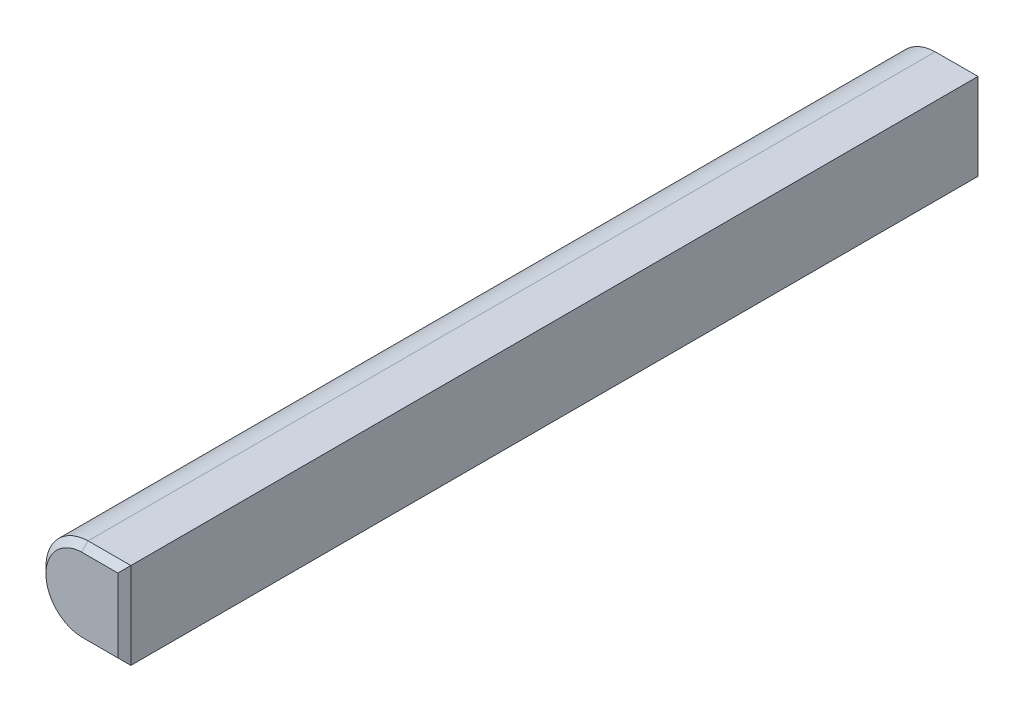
ISO-10303-21;
HEADER;
FILE_DESCRIPTION(('STEP AP214'),'2;1');
FILE_NAME('part.step','',(''),(''),'','','');
FILE_SCHEMA(('AUTOMOTIVE_DESIGN { 1 0 10303 214 1 1 1 1 }'));
ENDSEC;
DATA;
#1=APPLICATION_CONTEXT('core data for automotive mechanical design processes');
#2=APPLICATION_PROTOCOL_DEFINITION('international standard','automotive_design',2000,#1);
#3=PRODUCT_CONTEXT('',#1,'mechanical');
#4=PRODUCT('Part','Part','',(#3));
#5=PRODUCT_RELATED_PRODUCT_CATEGORY('part','',(#4));
#6=PRODUCT_DEFINITION_FORMATION('','',#4);
#7=PRODUCT_DEFINITION_CONTEXT('part definition',#1,'design');
#8=PRODUCT_DEFINITION('design','',#6,#7);
#9=PRODUCT_DEFINITION_SHAPE('','',#8);
#10=(LENGTH_UNIT() NAMED_UNIT(*) SI_UNIT(.MILLI.,.METRE.));
#11=(NAMED_UNIT(*) PLANE_ANGLE_UNIT() SI_UNIT($,.RADIAN.));
#12=(NAMED_UNIT(*) SI_UNIT($,.STERADIAN.) SOLID_ANGLE_UNIT());
#13=UNCERTAINTY_MEASURE_WITH_UNIT(LENGTH_MEASURE(1.E-05),#10,'distance_accuracy_value','');
#14=(GEOMETRIC_REPRESENTATION_CONTEXT(3) GLOBAL_UNCERTAINTY_ASSIGNED_CONTEXT((#13)) GLOBAL_UNIT_ASSIGNED_CONTEXT((#10,
#11,#12)) REPRESENTATION_CONTEXT('',''));
#15=CARTESIAN_POINT('',(0.,0.,0.));
#16=DIRECTION('',(0.,0.,1.));
#17=DIRECTION('',(1.,0.,0.));
#18=AXIS2_PLACEMENT_3D('',#15,#16,#17);
#19=CARTESIAN_POINT('',(3.85,3.99873397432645,79.5));
#20=DIRECTION('',(-1.,0.,0.));
#21=DIRECTION('',(0.,0.,1.));
#22=AXIS2_PLACEMENT_3D('',#19,#20,#21);
#23=PLANE('',#22);
#24=DIRECTION('',(0.,0.,-1.));
#25=VECTOR('',#24,1.);
#26=CARTESIAN_POINT('',(3.85,-3.99873397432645,79.5));
#27=LINE('',#26,#25);
#28=CARTESIAN_POINT('',(3.85,-3.99873397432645,78.9));
#29=VERTEX_POINT('',#28);
#30=CARTESIAN_POINT('',(3.85,-3.99873397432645,0.600000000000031));
#31=VERTEX_POINT('',#30);
#32=EDGE_CURVE('E233',#29,#31,#27,.T.);
#33=ORIENTED_EDGE('',*,*,#32,.T.);
#34=DIRECTION('',(0.,1.,0.));
#35=VECTOR('',#34,1.);
#36=CARTESIAN_POINT('',(3.85,3.99873397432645,0.600000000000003));
#37=LINE('',#36,#35);
#38=CARTESIAN_POINT('',(3.85,3.99873397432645,0.600000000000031));
#39=VERTEX_POINT('',#38);
#40=EDGE_CURVE('E230',#31,#39,#37,.T.);
#41=ORIENTED_EDGE('',*,*,#40,.T.);
#42=DIRECTION('',(0.,0.,-1.));
#43=VECTOR('',#42,1.);
#44=CARTESIAN_POINT('',(3.85,3.99873397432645,79.5));
#45=LINE('',#44,#43);
#46=CARTESIAN_POINT('',(3.85,3.99873397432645,78.9));
#47=VERTEX_POINT('',#46);
#48=EDGE_CURVE('E129',#47,#39,#45,.T.);
#49=ORIENTED_EDGE('',*,*,#48,.F.);
#50=DIRECTION('',(0.,-1.,0.));
#51=VECTOR('',#50,1.);
#52=CARTESIAN_POINT('',(3.85,-3.99873397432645,78.9));
#53=LINE('',#52,#51);
#54=EDGE_CURVE('E251',#47,#29,#53,.T.);
#55=ORIENTED_EDGE('',*,*,#54,.T.);
#56=EDGE_LOOP('',(#33,#41,#49,#55));
#57=FACE_BOUND('',#56,.T.);
#58=ADVANCED_FACE('F35',(#57),#23,.F.);
#59=CARTESIAN_POINT('',(-0.100631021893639,3.99873397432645,79.5));
#60=DIRECTION('',(0.,-1.,0.));
#61=DIRECTION('',(0.,0.,-1.));
#62=AXIS2_PLACEMENT_3D('',#59,#60,#61);
#63=PLANE('',#62);
#64=ORIENTED_EDGE('',*,*,#48,.T.);
#65=DIRECTION('',(-1.,0.,0.));
#66=VECTOR('',#65,1.);
#67=CARTESIAN_POINT('',(-0.100631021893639,3.99873397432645,0.600000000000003));
#68=LINE('',#67,#66);
#69=CARTESIAN_POINT('',(-0.100631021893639,3.99873397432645,0.600000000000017));
#70=VERTEX_POINT('',#69);
#71=EDGE_CURVE('E128',#39,#70,#68,.T.);
#72=ORIENTED_EDGE('',*,*,#71,.T.);
#73=DIRECTION('',(0.,0.,-1.));
#74=VECTOR('',#73,1.);
#75=CARTESIAN_POINT('',(-0.100631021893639,3.99873397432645,79.5));
#76=LINE('',#75,#74);
#77=CARTESIAN_POINT('',(-0.100631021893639,3.99873397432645,78.9));
#78=VERTEX_POINT('',#77);
#79=EDGE_CURVE('E111',#78,#70,#76,.T.);
#80=ORIENTED_EDGE('',*,*,#79,.F.);
#81=DIRECTION('',(1.,0.,0.));
#82=VECTOR('',#81,1.);
#83=CARTESIAN_POINT('',(3.85,3.99873397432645,78.9));
#84=LINE('',#83,#82);
#85=EDGE_CURVE('E125',#78,#47,#84,.T.);
#86=ORIENTED_EDGE('',*,*,#85,.T.);
#87=EDGE_LOOP('',(#64,#72,#80,#86));
#88=FACE_BOUND('',#87,.T.);
#89=ADVANCED_FACE('F124',(#88),#63,.F.);
#90=CARTESIAN_POINT('',(0.,0.,79.5));
#91=DIRECTION('',(0.,0.,-1.));
#92=DIRECTION('',(-1.,0.,0.));
#93=AXIS2_PLACEMENT_3D('',#90,#91,#92);
#94=CYLINDRICAL_SURFACE('',#93,4.);
#95=ORIENTED_EDGE('',*,*,#79,.T.);
#96=CARTESIAN_POINT('',(0.,0.,0.599999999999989));
#97=DIRECTION('',(0.,0.,1.));
#98=DIRECTION('',(1.,0.,0.));
#99=AXIS2_PLACEMENT_3D('',#96,#97,#98);
#100=CIRCLE('',#99,4.);
#101=CARTESIAN_POINT('',(-0.100631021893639,-3.99873397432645,0.600000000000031));
#102=VERTEX_POINT('',#101);
#103=EDGE_CURVE('E117',#70,#102,#100,.T.);
#104=ORIENTED_EDGE('',*,*,#103,.T.);
#105=DIRECTION('',(0.,0.,-1.));
#106=VECTOR('',#105,1.);
#107=CARTESIAN_POINT('',(-0.100631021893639,-3.99873397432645,79.5));
#108=LINE('',#107,#106);
#109=CARTESIAN_POINT('',(-0.100631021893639,-3.99873397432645,78.9));
#110=VERTEX_POINT('',#109);
#111=EDGE_CURVE('E113',#110,#102,#108,.T.);
#112=ORIENTED_EDGE('',*,*,#111,.F.);
#113=CARTESIAN_POINT('',(0.,0.,78.9));
#114=DIRECTION('',(0.,0.,1.));
#115=DIRECTION('',(1.,0.,0.));
#116=AXIS2_PLACEMENT_3D('',#113,#114,#115);
#117=CIRCLE('',#116,4.);
#118=EDGE_CURVE('E108',#110,#78,#117,.F.);
#119=ORIENTED_EDGE('',*,*,#118,.T.);
#120=EDGE_LOOP('',(#95,#104,#112,#119));
#121=FACE_BOUND('',#120,.T.);
#122=ADVANCED_FACE('F110',(#121),#94,.T.);
#123=CARTESIAN_POINT('',(3.85,-3.99873397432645,79.5));
#124=DIRECTION('',(0.,1.,0.));
#125=DIRECTION('',(0.,0.,1.));
#126=AXIS2_PLACEMENT_3D('',#123,#124,#125);
#127=PLANE('',#126);
#128=ORIENTED_EDGE('',*,*,#111,.T.);
#129=DIRECTION('',(1.,0.,0.));
#130=VECTOR('',#129,1.);
#131=CARTESIAN_POINT('',(3.85,-3.99873397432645,0.600000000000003));
#132=LINE('',#131,#130);
#133=EDGE_CURVE('E249',#102,#31,#132,.T.);
#134=ORIENTED_EDGE('',*,*,#133,.T.);
#135=ORIENTED_EDGE('',*,*,#32,.F.);
#136=DIRECTION('',(-1.,0.,0.));
#137=VECTOR('',#136,1.);
#138=CARTESIAN_POINT('',(-0.100631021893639,-3.99873397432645,78.9));
#139=LINE('',#138,#137);
#140=EDGE_CURVE('E247',#29,#110,#139,.T.);
#141=ORIENTED_EDGE('',*,*,#140,.T.);
#142=EDGE_LOOP('',(#128,#134,#135,#141));
#143=FACE_BOUND('',#142,.T.);
#144=ADVANCED_FACE('F262',(#143),#127,.F.);
#145=CARTESIAN_POINT('',(0.,0.,79.5));
#146=DIRECTION('',(0.,0.,1.));
#147=DIRECTION('',(1.,0.,0.));
#148=AXIS2_PLACEMENT_3D('',#145,#146,#147);
#149=PLANE('',#148);
#150=CARTESIAN_POINT('',(0.,0.,79.5));
#151=DIRECTION('',(0.,0.,1.));
#152=DIRECTION('',(1.,0.,0.));
#153=AXIS2_PLACEMENT_3D('',#150,#151,#152);
#154=CIRCLE('',#153,3.4);
#155=CARTESIAN_POINT('',(-0.092775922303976,3.39873397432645,79.5));
#156=VERTEX_POINT('',#155);
#157=CARTESIAN_POINT('',(-0.0927759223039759,-3.39873397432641,79.5));
#158=VERTEX_POINT('',#157);
#159=EDGE_CURVE('E51',#156,#158,#154,.T.);
#160=ORIENTED_EDGE('',*,*,#159,.T.);
#161=DIRECTION('',(1.,0.,0.));
#162=VECTOR('',#161,1.);
#163=CARTESIAN_POINT('',(3.85,-3.39873397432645,79.5));
#164=LINE('',#163,#162);
#165=CARTESIAN_POINT('',(3.25,-3.39873397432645,79.5));
#166=VERTEX_POINT('',#165);
#167=EDGE_CURVE('E11',#158,#166,#164,.T.);
#168=ORIENTED_EDGE('',*,*,#167,.T.);
#169=DIRECTION('',(0.,1.,0.));
#170=VECTOR('',#169,1.);
#171=CARTESIAN_POINT('',(3.25,3.99873397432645,79.5));
#172=LINE('',#171,#170);
#173=CARTESIAN_POINT('',(3.25,3.39873397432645,79.5));
#174=VERTEX_POINT('',#173);
#175=EDGE_CURVE('E254',#166,#174,#172,.T.);
#176=ORIENTED_EDGE('',*,*,#175,.T.);
#177=DIRECTION('',(-1.,0.,0.));
#178=VECTOR('',#177,1.);
#179=CARTESIAN_POINT('',(-0.100631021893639,3.39873397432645,79.5));
#180=LINE('',#179,#178);
#181=EDGE_CURVE('E62',#174,#156,#180,.T.);
#182=ORIENTED_EDGE('',*,*,#181,.T.);
#183=EDGE_LOOP('',(#160,#168,#176,#182));
#184=FACE_BOUND('',#183,.T.);
#185=ADVANCED_FACE('F257',(#184),#149,.T.);
#186=CARTESIAN_POINT('',(0.,0.,0.));
#187=DIRECTION('',(0.,0.,1.));
#188=DIRECTION('',(1.,0.,0.));
#189=AXIS2_PLACEMENT_3D('',#186,#187,#188);
#190=PLANE('',#189);
#191=CARTESIAN_POINT('',(0.,0.,0.));
#192=DIRECTION('',(0.,0.,1.));
#193=DIRECTION('',(1.,0.,0.));
#194=AXIS2_PLACEMENT_3D('',#191,#192,#193);
#195=CIRCLE('',#194,3.4);
#196=CARTESIAN_POINT('',(-0.092775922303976,-3.39873397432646,0.));
#197=VERTEX_POINT('',#196);
#198=CARTESIAN_POINT('',(-0.0927759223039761,3.39873397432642,0.));
#199=VERTEX_POINT('',#198);
#200=EDGE_CURVE('E243',#197,#199,#195,.F.);
#201=ORIENTED_EDGE('',*,*,#200,.T.);
#202=DIRECTION('',(1.,0.,0.));
#203=VECTOR('',#202,1.);
#204=CARTESIAN_POINT('',(0.,3.39873397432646,0.));
#205=LINE('',#204,#203);
#206=CARTESIAN_POINT('',(3.25,3.39873397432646,0.));
#207=VERTEX_POINT('',#206);
#208=EDGE_CURVE('E118',#199,#207,#205,.T.);
#209=ORIENTED_EDGE('',*,*,#208,.T.);
#210=DIRECTION('',(0.,-1.,0.));
#211=VECTOR('',#210,1.);
#212=CARTESIAN_POINT('',(3.25,0.,0.));
#213=LINE('',#212,#211);
#214=CARTESIAN_POINT('',(3.25,-3.39873397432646,0.));
#215=VERTEX_POINT('',#214);
#216=EDGE_CURVE('E228',#207,#215,#213,.T.);
#217=ORIENTED_EDGE('',*,*,#216,.T.);
#218=DIRECTION('',(-1.,0.,0.));
#219=VECTOR('',#218,1.);
#220=CARTESIAN_POINT('',(0.,-3.39873397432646,0.));
#221=LINE('',#220,#219);
#222=EDGE_CURVE('E241',#215,#197,#221,.T.);
#223=ORIENTED_EDGE('',*,*,#222,.T.);
#224=EDGE_LOOP('',(#201,#209,#217,#223));
#225=FACE_BOUND('',#224,.T.);
#226=ADVANCED_FACE('F215',(#225),#190,.F.);
#227=CARTESIAN_POINT('',(3.85,-3.99873397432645,0.600000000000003));
#228=DIRECTION('',(0.,0.707106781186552,0.707106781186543));
#229=DIRECTION('',(1.,0.,0.));
#230=AXIS2_PLACEMENT_3D('',#227,#228,#229);
#231=PLANE('',#230);
#232=CARTESIAN_POINT('',(-0.100631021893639,-3.99873397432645,0.599999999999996));
#233=CARTESIAN_POINT('',(-0.0993750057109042,-3.8987336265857,0.499999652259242));
#234=CARTESIAN_POINT('',(-0.098092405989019,-3.79873345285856,0.39999947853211));
#235=CARTESIAN_POINT('',(-0.0954740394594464,-3.59873345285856,0.199999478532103));
#236=CARTESIAN_POINT('',(-0.0941382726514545,-3.49873362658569,0.0999996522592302));
#237=CARTESIAN_POINT('',(-0.0927759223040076,-3.39873397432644,0.));
#238=B_SPLINE_CURVE_WITH_KNOTS('',3,(#232,#233,#234,#235,#236,#237),.UNSPECIFIED.,.F.,.F.,(4,2,
4),(0.,0.424282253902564,0.848564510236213),.UNSPECIFIED.);
#239=EDGE_CURVE('E201',#197,#102,#238,.F.);
#240=ORIENTED_EDGE('',*,*,#239,.F.);
#241=ORIENTED_EDGE('',*,*,#222,.F.);
#242=DIRECTION('',(-0.577350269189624,0.577350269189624,-0.57735026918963));
#243=VECTOR('',#242,1.);
#244=CARTESIAN_POINT('',(1.18417735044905,-1.33291132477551,-2.06582264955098));
#245=LINE('',#244,#243);
#246=EDGE_CURVE('E207',#31,#215,#245,.T.);
#247=ORIENTED_EDGE('',*,*,#246,.F.);
#248=ORIENTED_EDGE('',*,*,#133,.F.);
#249=EDGE_LOOP('',(#240,#241,#247,#248));
#250=FACE_BOUND('',#249,.T.);
#251=ADVANCED_FACE('F209',(#250),#231,.F.);
#252=CARTESIAN_POINT('',(3.85,3.99873397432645,0.600000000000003));
#253=DIRECTION('',(-0.707106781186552,0.,0.707106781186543));
#254=DIRECTION('',(0.,1.,0.));
#255=AXIS2_PLACEMENT_3D('',#252,#253,#254);
#256=PLANE('',#255);
#257=ORIENTED_EDGE('',*,*,#246,.T.);
#258=ORIENTED_EDGE('',*,*,#216,.F.);
#259=DIRECTION('',(0.577350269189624,0.577350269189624,0.57735026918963));
#260=VECTOR('',#259,1.);
#261=CARTESIAN_POINT('',(3.85,3.99873397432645,0.600000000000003));
#262=LINE('',#261,#260);
#263=EDGE_CURVE('E139',#39,#207,#262,.F.);
#264=ORIENTED_EDGE('',*,*,#263,.F.);
#265=ORIENTED_EDGE('',*,*,#40,.F.);
#266=EDGE_LOOP('',(#257,#258,#264,#265));
#267=FACE_BOUND('',#266,.T.);
#268=ADVANCED_FACE('F190',(#267),#256,.F.);
#269=CARTESIAN_POINT('',(0.,0.,0.599999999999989));
#270=DIRECTION('',(0.,0.,1.));
#271=DIRECTION('',(1.,0.,0.));
#272=AXIS2_PLACEMENT_3D('',#269,#270,#271);
#273=CONICAL_SURFACE('',#272,4.,0.785398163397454);
#274=ORIENTED_EDGE('',*,*,#239,.T.);
#275=ORIENTED_EDGE('',*,*,#103,.F.);
#276=CARTESIAN_POINT('',(-0.100631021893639,3.99873397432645,0.599999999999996));
#277=CARTESIAN_POINT('',(-0.099375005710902,3.8987336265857,0.499999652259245));
#278=CARTESIAN_POINT('',(-0.0980924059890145,3.79873345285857,0.399999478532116));
#279=CARTESIAN_POINT('',(-0.0954740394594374,3.59873345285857,0.199999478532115));
#280=CARTESIAN_POINT('',(-0.0941382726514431,3.4987336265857,0.0999996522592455));
#281=CARTESIAN_POINT('',(-0.092775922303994,3.39873397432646,0.));
#282=B_SPLINE_CURVE_WITH_KNOTS('',3,(#276,#277,#278,#279,#280,#281),.UNSPECIFIED.,.F.,.F.,(4,2,
4),(0.,0.424282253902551,0.848564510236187),.UNSPECIFIED.);
#283=EDGE_CURVE('E138',#199,#70,#282,.F.);
#284=ORIENTED_EDGE('',*,*,#283,.F.);
#285=ORIENTED_EDGE('',*,*,#200,.F.);
#286=EDGE_LOOP('',(#274,#275,#284,#285));
#287=FACE_BOUND('',#286,.T.);
#288=ADVANCED_FACE('F182',(#287),#273,.T.);
#289=CARTESIAN_POINT('',(-0.100631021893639,3.99873397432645,0.600000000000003));
#290=DIRECTION('',(0.,-0.707106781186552,0.707106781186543));
#291=DIRECTION('',(-1.,0.,0.));
#292=AXIS2_PLACEMENT_3D('',#289,#290,#291);
#293=PLANE('',#292);
#294=ORIENTED_EDGE('',*,*,#263,.T.);
#295=ORIENTED_EDGE('',*,*,#208,.F.);
#296=ORIENTED_EDGE('',*,*,#283,.T.);
#297=ORIENTED_EDGE('',*,*,#71,.F.);
#298=EDGE_LOOP('',(#294,#295,#296,#297));
#299=FACE_BOUND('',#298,.T.);
#300=ADVANCED_FACE('F189',(#299),#293,.F.);
#301=CARTESIAN_POINT('',(0.,3.39873397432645,79.5));
#302=DIRECTION('',(0.,0.707106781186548,0.707106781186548));
#303=DIRECTION('',(1.,0.,0.));
#304=AXIS2_PLACEMENT_3D('',#301,#302,#303);
#305=PLANE('',#304);
#306=DIRECTION('',(-0.577350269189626,-0.577350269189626,0.577350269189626));
#307=VECTOR('',#306,1.);
#308=CARTESIAN_POINT('',(2.11708867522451,2.26582264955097,80.6329113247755));
#309=LINE('',#308,#307);
#310=EDGE_CURVE('E134',#47,#174,#309,.T.);
#311=ORIENTED_EDGE('',*,*,#310,.F.);
#312=ORIENTED_EDGE('',*,*,#85,.F.);
#313=CARTESIAN_POINT('',(-0.100631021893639,3.99873397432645,78.9));
#314=CARTESIAN_POINT('',(-0.0993750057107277,3.8987336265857,79.0000003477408));
#315=CARTESIAN_POINT('',(-0.0980924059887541,3.79873345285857,79.1000005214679));
#316=CARTESIAN_POINT('',(-0.0954740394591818,3.59873345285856,79.3000005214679));
#317=CARTESIAN_POINT('',(-0.0941382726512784,3.49873362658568,79.4000003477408));
#318=CARTESIAN_POINT('',(-0.0927759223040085,3.39873397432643,79.5));
#319=B_SPLINE_CURVE_WITH_KNOTS('',3,(#313,#314,#315,#316,#317,#318),.UNSPECIFIED.,.F.,.F.,(4,2,
4),(0.,0.424282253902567,0.84856451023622),.UNSPECIFIED.);
#320=EDGE_CURVE('E41',#156,#78,#319,.F.);
#321=ORIENTED_EDGE('',*,*,#320,.F.);
#322=ORIENTED_EDGE('',*,*,#181,.F.);
#323=EDGE_LOOP('',(#311,#312,#321,#322));
#324=FACE_BOUND('',#323,.T.);
#325=ADVANCED_FACE('F38',(#324),#305,.T.);
#326=CARTESIAN_POINT('',(0.,0.,79.5));
#327=DIRECTION('',(0.,0.,-1.));
#328=DIRECTION('',(-1.,0.,0.));
#329=AXIS2_PLACEMENT_3D('',#326,#327,#328);
#330=CONICAL_SURFACE('',#329,3.4,0.785398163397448);
#331=ORIENTED_EDGE('',*,*,#320,.T.);
#332=ORIENTED_EDGE('',*,*,#118,.F.);
#333=CARTESIAN_POINT('',(-0.100631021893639,-3.99873397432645,78.9));
#334=CARTESIAN_POINT('',(-0.0993750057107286,-3.8987336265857,79.0000003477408));
#335=CARTESIAN_POINT('',(-0.0980924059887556,-3.79873345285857,79.1000005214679));
#336=CARTESIAN_POINT('',(-0.0954740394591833,-3.59873345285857,79.3000005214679));
#337=CARTESIAN_POINT('',(-0.0941382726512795,-3.4987336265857,79.4000003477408));
#338=CARTESIAN_POINT('',(-0.0927759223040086,-3.39873397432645,79.5));
#339=B_SPLINE_CURVE_WITH_KNOTS('',3,(#333,#334,#335,#336,#337,#338),.UNSPECIFIED.,.F.,.F.,(4,2,
4),(0.,0.424282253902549,0.848564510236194),.UNSPECIFIED.);
#340=EDGE_CURVE('E141',#158,#110,#339,.F.);
#341=ORIENTED_EDGE('',*,*,#340,.F.);
#342=ORIENTED_EDGE('',*,*,#159,.F.);
#343=EDGE_LOOP('',(#331,#332,#341,#342));
#344=FACE_BOUND('',#343,.T.);
#345=ADVANCED_FACE('F137',(#344),#330,.T.);
#346=CARTESIAN_POINT('',(3.25,0.,79.5));
#347=DIRECTION('',(0.707106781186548,0.,0.707106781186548));
#348=DIRECTION('',(0.,-1.,0.));
#349=AXIS2_PLACEMENT_3D('',#346,#347,#348);
#350=PLANE('',#349);
#351=ORIENTED_EDGE('',*,*,#310,.T.);
#352=ORIENTED_EDGE('',*,*,#175,.F.);
#353=DIRECTION('',(0.577350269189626,-0.577350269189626,-0.577350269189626));
#354=VECTOR('',#353,1.);
#355=CARTESIAN_POINT('',(2.11708867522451,-2.26582264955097,80.6329113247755));
#356=LINE('',#355,#354);
#357=EDGE_CURVE('E144',#29,#166,#356,.F.);
#358=ORIENTED_EDGE('',*,*,#357,.F.);
#359=ORIENTED_EDGE('',*,*,#54,.F.);
#360=EDGE_LOOP('',(#351,#352,#358,#359));
#361=FACE_BOUND('',#360,.T.);
#362=ADVANCED_FACE('F163',(#361),#350,.T.);
#363=CARTESIAN_POINT('',(0.,-3.39873397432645,79.5));
#364=DIRECTION('',(0.,-0.707106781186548,0.707106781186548));
#365=DIRECTION('',(-1.,0.,0.));
#366=AXIS2_PLACEMENT_3D('',#363,#364,#365);
#367=PLANE('',#366);
#368=ORIENTED_EDGE('',*,*,#340,.T.);
#369=ORIENTED_EDGE('',*,*,#140,.F.);
#370=ORIENTED_EDGE('',*,*,#357,.T.);
#371=ORIENTED_EDGE('',*,*,#167,.F.);
#372=EDGE_LOOP('',(#368,#369,#370,#371));
#373=FACE_BOUND('',#372,.T.);
#374=ADVANCED_FACE('F157',(#373),#367,.T.);
#375=CLOSED_SHELL('',(#58,#89,#122,#144,#185,#226,#251,#268,#288,#300,#325,#345,#362,#374));
#376=MANIFOLD_SOLID_BREP('B2',#375);
#377=ADVANCED_BREP_SHAPE_REPRESENTATION('',(#18,#376),#14);
#378=SHAPE_DEFINITION_REPRESENTATION(#9,#377);
ENDSEC;
END-ISO-10303-21;
